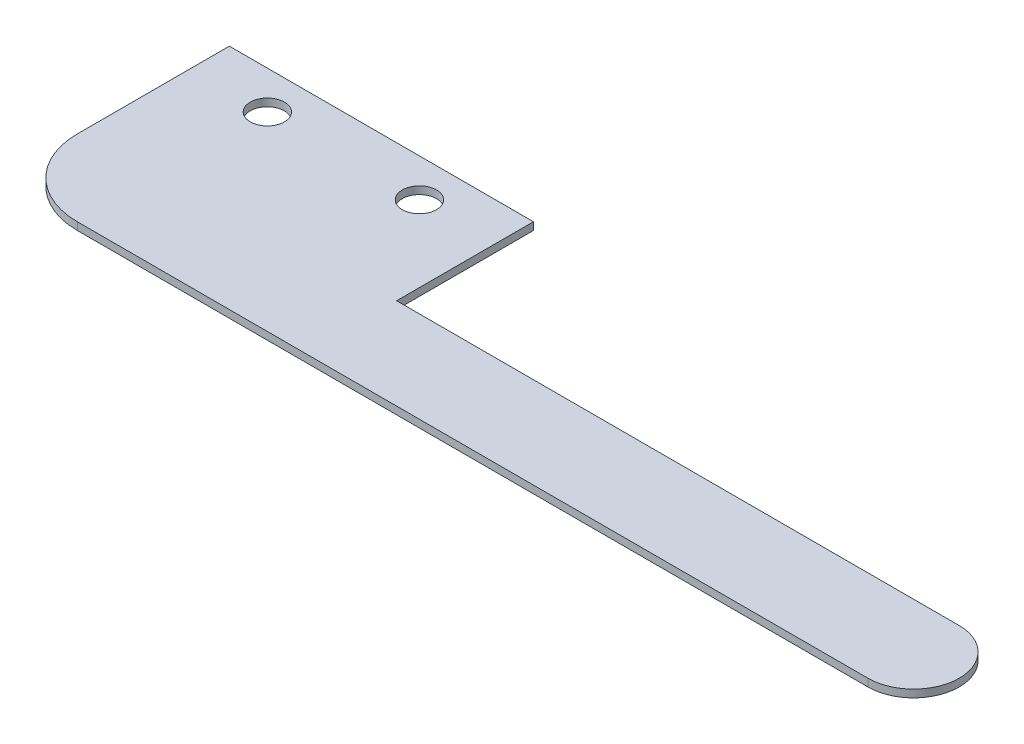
ISO-10303-21;
HEADER;
FILE_DESCRIPTION(('STEP AP214'),'2;1');
FILE_NAME('part.step','',(''),(''),'','','');
FILE_SCHEMA(('AUTOMOTIVE_DESIGN { 1 0 10303 214 1 1 1 1 }'));
ENDSEC;
DATA;
#1=APPLICATION_CONTEXT('core data for automotive mechanical design processes');
#2=APPLICATION_PROTOCOL_DEFINITION('international standard','automotive_design',2000,#1);
#3=PRODUCT_CONTEXT('',#1,'mechanical');
#4=PRODUCT('Part','Part','',(#3));
#5=PRODUCT_RELATED_PRODUCT_CATEGORY('part','',(#4));
#6=PRODUCT_DEFINITION_FORMATION('','',#4);
#7=PRODUCT_DEFINITION_CONTEXT('part definition',#1,'design');
#8=PRODUCT_DEFINITION('design','',#6,#7);
#9=PRODUCT_DEFINITION_SHAPE('','',#8);
#10=(LENGTH_UNIT() NAMED_UNIT(*) SI_UNIT(.MILLI.,.METRE.));
#11=(NAMED_UNIT(*) PLANE_ANGLE_UNIT() SI_UNIT($,.RADIAN.));
#12=(NAMED_UNIT(*) SI_UNIT($,.STERADIAN.) SOLID_ANGLE_UNIT());
#13=UNCERTAINTY_MEASURE_WITH_UNIT(LENGTH_MEASURE(1.E-05),#10,'distance_accuracy_value','');
#14=(GEOMETRIC_REPRESENTATION_CONTEXT(3) GLOBAL_UNCERTAINTY_ASSIGNED_CONTEXT((#13)) GLOBAL_UNIT_ASSIGNED_CONTEXT((#10,
#11,#12)) REPRESENTATION_CONTEXT('',''));
#15=CARTESIAN_POINT('',(0.,0.,0.));
#16=DIRECTION('',(0.,0.,1.));
#17=DIRECTION('',(1.,0.,0.));
#18=AXIS2_PLACEMENT_3D('',#15,#16,#17);
#19=CARTESIAN_POINT('',(10.,1.,-10.));
#20=DIRECTION('',(0.,-1.,0.));
#21=DIRECTION('',(0.,0.,-1.));
#22=AXIS2_PLACEMENT_3D('',#19,#20,#21);
#23=PLANE('',#22);
#24=CARTESIAN_POINT('',(10.,1.,-25.));
#25=DIRECTION('',(0.,1.,0.));
#26=DIRECTION('',(0.,0.,1.));
#27=AXIS2_PLACEMENT_3D('',#24,#25,#26);
#28=CIRCLE('',#27,2.25);
#29=CARTESIAN_POINT('',(10.,1.,-22.75));
#30=VERTEX_POINT('',#29);
#31=EDGE_CURVE('E126',#30,#30,#28,.T.);
#32=ORIENTED_EDGE('',*,*,#31,.F.);
#33=EDGE_LOOP('',(#32));
#34=FACE_BOUND('',#33,.T.);
#35=DIRECTION('',(0.,0.,-1.));
#36=VECTOR('',#35,1.);
#37=CARTESIAN_POINT('',(40.,1.,-12.));
#38=LINE('',#37,#36);
#39=CARTESIAN_POINT('',(40.,1.,-12.));
#40=VERTEX_POINT('',#39);
#41=CARTESIAN_POINT('',(40.,1.,-30.));
#42=VERTEX_POINT('',#41);
#43=EDGE_CURVE('E135',#40,#42,#38,.T.);
#44=ORIENTED_EDGE('',*,*,#43,.T.);
#45=DIRECTION('',(-1.,0.,0.));
#46=VECTOR('',#45,1.);
#47=CARTESIAN_POINT('',(0.,1.,-30.));
#48=LINE('',#47,#46);
#49=CARTESIAN_POINT('',(0.,1.,-30.));
#50=VERTEX_POINT('',#49);
#51=EDGE_CURVE('E88',#42,#50,#48,.T.);
#52=ORIENTED_EDGE('',*,*,#51,.T.);
#53=DIRECTION('',(0.,0.,1.));
#54=VECTOR('',#53,1.);
#55=CARTESIAN_POINT('',(0.,1.,-10.0000000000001));
#56=LINE('',#55,#54);
#57=CARTESIAN_POINT('',(0.,1.,-10.0000000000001));
#58=VERTEX_POINT('',#57);
#59=EDGE_CURVE('E147',#50,#58,#56,.T.);
#60=ORIENTED_EDGE('',*,*,#59,.T.);
#61=CARTESIAN_POINT('',(10.,1.,-10.));
#62=DIRECTION('',(0.,1.,0.));
#63=DIRECTION('',(0.,0.,-1.));
#64=AXIS2_PLACEMENT_3D('',#61,#62,#63);
#65=CIRCLE('',#64,10.);
#66=CARTESIAN_POINT('',(10.0000000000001,1.,0.));
#67=VERTEX_POINT('',#66);
#68=EDGE_CURVE('E104',#58,#67,#65,.T.);
#69=ORIENTED_EDGE('',*,*,#68,.T.);
#70=DIRECTION('',(1.,0.,0.));
#71=VECTOR('',#70,1.);
#72=CARTESIAN_POINT('',(10.0000000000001,1.,0.));
#73=LINE('',#72,#71);
#74=CARTESIAN_POINT('',(114.,1.,0.));
#75=VERTEX_POINT('',#74);
#76=EDGE_CURVE('E98',#67,#75,#73,.T.);
#77=ORIENTED_EDGE('',*,*,#76,.T.);
#78=CARTESIAN_POINT('',(114.,1.,-6.));
#79=DIRECTION('',(0.,1.,0.));
#80=DIRECTION('',(0.,0.,1.));
#81=AXIS2_PLACEMENT_3D('',#78,#79,#80);
#82=CIRCLE('',#81,6.);
#83=CARTESIAN_POINT('',(114.,1.,-12.));
#84=VERTEX_POINT('',#83);
#85=EDGE_CURVE('E102',#75,#84,#82,.T.);
#86=ORIENTED_EDGE('',*,*,#85,.T.);
#87=DIRECTION('',(-1.,0.,0.));
#88=VECTOR('',#87,1.);
#89=CARTESIAN_POINT('',(40.,1.,-12.));
#90=LINE('',#89,#88);
#91=EDGE_CURVE('E48',#84,#40,#90,.T.);
#92=ORIENTED_EDGE('',*,*,#91,.T.);
#93=EDGE_LOOP('',(#44,#52,#60,#69,#77,#86,#92));
#94=FACE_BOUND('',#93,.T.);
#95=CARTESIAN_POINT('',(30.,1.,-25.));
#96=DIRECTION('',(0.,1.,0.));
#97=DIRECTION('',(0.,0.,1.));
#98=AXIS2_PLACEMENT_3D('',#95,#96,#97);
#99=CIRCLE('',#98,2.25);
#100=CARTESIAN_POINT('',(30.,1.,-22.75));
#101=VERTEX_POINT('',#100);
#102=EDGE_CURVE('E162',#101,#101,#99,.T.);
#103=ORIENTED_EDGE('',*,*,#102,.F.);
#104=EDGE_LOOP('',(#103));
#105=FACE_BOUND('',#104,.T.);
#106=ADVANCED_FACE('F31',(#34,#94,#105),#23,.F.);
#107=CARTESIAN_POINT('',(10.,0.,-10.));
#108=DIRECTION('',(0.,-1.,0.));
#109=DIRECTION('',(0.,0.,-1.));
#110=AXIS2_PLACEMENT_3D('',#107,#108,#109);
#111=PLANE('',#110);
#112=CARTESIAN_POINT('',(10.,0.,-25.));
#113=DIRECTION('',(0.,1.,0.));
#114=DIRECTION('',(0.,0.,1.));
#115=AXIS2_PLACEMENT_3D('',#112,#113,#114);
#116=CIRCLE('',#115,2.25);
#117=CARTESIAN_POINT('',(10.,0.,-22.75));
#118=VERTEX_POINT('',#117);
#119=EDGE_CURVE('E159',#118,#118,#116,.T.);
#120=ORIENTED_EDGE('',*,*,#119,.T.);
#121=EDGE_LOOP('',(#120));
#122=FACE_BOUND('',#121,.T.);
#123=DIRECTION('',(0.,0.,-1.));
#124=VECTOR('',#123,1.);
#125=CARTESIAN_POINT('',(40.,0.,-12.));
#126=LINE('',#125,#124);
#127=CARTESIAN_POINT('',(40.,0.,-12.));
#128=VERTEX_POINT('',#127);
#129=CARTESIAN_POINT('',(40.,0.,-30.));
#130=VERTEX_POINT('',#129);
#131=EDGE_CURVE('E122',#128,#130,#126,.T.);
#132=ORIENTED_EDGE('',*,*,#131,.F.);
#133=DIRECTION('',(-1.,0.,0.));
#134=VECTOR('',#133,1.);
#135=CARTESIAN_POINT('',(40.,0.,-12.));
#136=LINE('',#135,#134);
#137=CARTESIAN_POINT('',(114.,0.,-12.));
#138=VERTEX_POINT('',#137);
#139=EDGE_CURVE('E80',#138,#128,#136,.T.);
#140=ORIENTED_EDGE('',*,*,#139,.F.);
#141=CARTESIAN_POINT('',(114.,0.,-6.));
#142=DIRECTION('',(0.,1.,0.));
#143=DIRECTION('',(0.,0.,1.));
#144=AXIS2_PLACEMENT_3D('',#141,#142,#143);
#145=CIRCLE('',#144,6.);
#146=CARTESIAN_POINT('',(114.,0.,0.));
#147=VERTEX_POINT('',#146);
#148=EDGE_CURVE('E74',#147,#138,#145,.T.);
#149=ORIENTED_EDGE('',*,*,#148,.F.);
#150=DIRECTION('',(1.,0.,0.));
#151=VECTOR('',#150,1.);
#152=CARTESIAN_POINT('',(10.0000000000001,0.,0.));
#153=LINE('',#152,#151);
#154=CARTESIAN_POINT('',(10.0000000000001,0.,0.));
#155=VERTEX_POINT('',#154);
#156=EDGE_CURVE('E112',#155,#147,#153,.T.);
#157=ORIENTED_EDGE('',*,*,#156,.F.);
#158=CARTESIAN_POINT('',(10.,0.,-10.));
#159=DIRECTION('',(0.,1.,0.));
#160=DIRECTION('',(0.,0.,-1.));
#161=AXIS2_PLACEMENT_3D('',#158,#159,#160);
#162=CIRCLE('',#161,10.);
#163=CARTESIAN_POINT('',(0.,0.,-10.0000000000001));
#164=VERTEX_POINT('',#163);
#165=EDGE_CURVE('E130',#164,#155,#162,.T.);
#166=ORIENTED_EDGE('',*,*,#165,.F.);
#167=DIRECTION('',(0.,0.,1.));
#168=VECTOR('',#167,1.);
#169=CARTESIAN_POINT('',(0.,0.,-10.0000000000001));
#170=LINE('',#169,#168);
#171=CARTESIAN_POINT('',(0.,0.,-30.));
#172=VERTEX_POINT('',#171);
#173=EDGE_CURVE('E128',#172,#164,#170,.T.);
#174=ORIENTED_EDGE('',*,*,#173,.F.);
#175=DIRECTION('',(-1.,0.,0.));
#176=VECTOR('',#175,1.);
#177=CARTESIAN_POINT('',(0.,0.,-30.));
#178=LINE('',#177,#176);
#179=EDGE_CURVE('E125',#130,#172,#178,.T.);
#180=ORIENTED_EDGE('',*,*,#179,.F.);
#181=EDGE_LOOP('',(#132,#140,#149,#157,#166,#174,#180));
#182=FACE_BOUND('',#181,.T.);
#183=CARTESIAN_POINT('',(30.,0.,-25.));
#184=DIRECTION('',(0.,1.,0.));
#185=DIRECTION('',(0.,0.,1.));
#186=AXIS2_PLACEMENT_3D('',#183,#184,#185);
#187=CIRCLE('',#186,2.25);
#188=CARTESIAN_POINT('',(30.,0.,-22.75));
#189=VERTEX_POINT('',#188);
#190=EDGE_CURVE('E165',#189,#189,#187,.T.);
#191=ORIENTED_EDGE('',*,*,#190,.T.);
#192=EDGE_LOOP('',(#191));
#193=FACE_BOUND('',#192,.T.);
#194=ADVANCED_FACE('F151',(#122,#182,#193),#111,.T.);
#195=CARTESIAN_POINT('',(40.,1.,-12.));
#196=DIRECTION('',(-1.,0.,0.));
#197=DIRECTION('',(0.,0.,1.));
#198=AXIS2_PLACEMENT_3D('',#195,#196,#197);
#199=PLANE('',#198);
#200=ORIENTED_EDGE('',*,*,#131,.T.);
#201=DIRECTION('',(0.,-1.,0.));
#202=VECTOR('',#201,1.);
#203=CARTESIAN_POINT('',(40.,1.,-30.));
#204=LINE('',#203,#202);
#205=EDGE_CURVE('E11',#42,#130,#204,.T.);
#206=ORIENTED_EDGE('',*,*,#205,.F.);
#207=ORIENTED_EDGE('',*,*,#43,.F.);
#208=DIRECTION('',(0.,-1.,0.));
#209=VECTOR('',#208,1.);
#210=CARTESIAN_POINT('',(40.,1.,-12.));
#211=LINE('',#210,#209);
#212=EDGE_CURVE('E118',#40,#128,#211,.T.);
#213=ORIENTED_EDGE('',*,*,#212,.T.);
#214=EDGE_LOOP('',(#200,#206,#207,#213));
#215=FACE_BOUND('',#214,.T.);
#216=ADVANCED_FACE('F33',(#215),#199,.F.);
#217=CARTESIAN_POINT('',(0.,1.,-30.));
#218=DIRECTION('',(0.,0.,1.));
#219=DIRECTION('',(1.,0.,0.));
#220=AXIS2_PLACEMENT_3D('',#217,#218,#219);
#221=PLANE('',#220);
#222=ORIENTED_EDGE('',*,*,#179,.T.);
#223=DIRECTION('',(0.,-1.,0.));
#224=VECTOR('',#223,1.);
#225=CARTESIAN_POINT('',(0.,1.,-30.));
#226=LINE('',#225,#224);
#227=EDGE_CURVE('E40',#50,#172,#226,.T.);
#228=ORIENTED_EDGE('',*,*,#227,.F.);
#229=ORIENTED_EDGE('',*,*,#51,.F.);
#230=ORIENTED_EDGE('',*,*,#205,.T.);
#231=EDGE_LOOP('',(#222,#228,#229,#230));
#232=FACE_BOUND('',#231,.T.);
#233=ADVANCED_FACE('F196',(#232),#221,.F.);
#234=CARTESIAN_POINT('',(0.,1.,-10.0000000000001));
#235=DIRECTION('',(1.,0.,0.));
#236=DIRECTION('',(0.,0.,-1.));
#237=AXIS2_PLACEMENT_3D('',#234,#235,#236);
#238=PLANE('',#237);
#239=ORIENTED_EDGE('',*,*,#173,.T.);
#240=DIRECTION('',(0.,-1.,0.));
#241=VECTOR('',#240,1.);
#242=CARTESIAN_POINT('',(0.,1.,-10.0000000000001));
#243=LINE('',#242,#241);
#244=EDGE_CURVE('E139',#58,#164,#243,.T.);
#245=ORIENTED_EDGE('',*,*,#244,.F.);
#246=ORIENTED_EDGE('',*,*,#59,.F.);
#247=ORIENTED_EDGE('',*,*,#227,.T.);
#248=EDGE_LOOP('',(#239,#245,#246,#247));
#249=FACE_BOUND('',#248,.T.);
#250=ADVANCED_FACE('F145',(#249),#238,.F.);
#251=CARTESIAN_POINT('',(10.,1.,-10.));
#252=DIRECTION('',(0.,-1.,0.));
#253=DIRECTION('',(0.,0.,-1.));
#254=AXIS2_PLACEMENT_3D('',#251,#252,#253);
#255=CYLINDRICAL_SURFACE('',#254,10.);
#256=ORIENTED_EDGE('',*,*,#165,.T.);
#257=DIRECTION('',(0.,-1.,0.));
#258=VECTOR('',#257,1.);
#259=CARTESIAN_POINT('',(10.0000000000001,1.,0.));
#260=LINE('',#259,#258);
#261=EDGE_CURVE('E113',#67,#155,#260,.T.);
#262=ORIENTED_EDGE('',*,*,#261,.F.);
#263=ORIENTED_EDGE('',*,*,#68,.F.);
#264=ORIENTED_EDGE('',*,*,#244,.T.);
#265=EDGE_LOOP('',(#256,#262,#263,#264));
#266=FACE_BOUND('',#265,.T.);
#267=ADVANCED_FACE('F154',(#266),#255,.T.);
#268=CARTESIAN_POINT('',(10.0000000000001,1.,0.));
#269=DIRECTION('',(0.,0.,-1.));
#270=DIRECTION('',(-1.,0.,0.));
#271=AXIS2_PLACEMENT_3D('',#268,#269,#270);
#272=PLANE('',#271);
#273=ORIENTED_EDGE('',*,*,#156,.T.);
#274=DIRECTION('',(0.,-1.,0.));
#275=VECTOR('',#274,1.);
#276=CARTESIAN_POINT('',(114.,1.,0.));
#277=LINE('',#276,#275);
#278=EDGE_CURVE('E109',#75,#147,#277,.T.);
#279=ORIENTED_EDGE('',*,*,#278,.F.);
#280=ORIENTED_EDGE('',*,*,#76,.F.);
#281=ORIENTED_EDGE('',*,*,#261,.T.);
#282=EDGE_LOOP('',(#273,#279,#280,#281));
#283=FACE_BOUND('',#282,.T.);
#284=ADVANCED_FACE('F110',(#283),#272,.F.);
#285=CARTESIAN_POINT('',(114.,1.,-6.));
#286=DIRECTION('',(0.,-1.,0.));
#287=DIRECTION('',(0.,0.,-1.));
#288=AXIS2_PLACEMENT_3D('',#285,#286,#287);
#289=CYLINDRICAL_SURFACE('',#288,6.);
#290=ORIENTED_EDGE('',*,*,#148,.T.);
#291=DIRECTION('',(0.,-1.,0.));
#292=VECTOR('',#291,1.);
#293=CARTESIAN_POINT('',(114.,1.,-12.));
#294=LINE('',#293,#292);
#295=EDGE_CURVE('E114',#84,#138,#294,.T.);
#296=ORIENTED_EDGE('',*,*,#295,.F.);
#297=ORIENTED_EDGE('',*,*,#85,.F.);
#298=ORIENTED_EDGE('',*,*,#278,.T.);
#299=EDGE_LOOP('',(#290,#296,#297,#298));
#300=FACE_BOUND('',#299,.T.);
#301=ADVANCED_FACE('F116',(#300),#289,.T.);
#302=CARTESIAN_POINT('',(40.,1.,-12.));
#303=DIRECTION('',(0.,0.,1.));
#304=DIRECTION('',(1.,0.,0.));
#305=AXIS2_PLACEMENT_3D('',#302,#303,#304);
#306=PLANE('',#305);
#307=ORIENTED_EDGE('',*,*,#139,.T.);
#308=ORIENTED_EDGE('',*,*,#212,.F.);
#309=ORIENTED_EDGE('',*,*,#91,.F.);
#310=ORIENTED_EDGE('',*,*,#295,.T.);
#311=EDGE_LOOP('',(#307,#308,#309,#310));
#312=FACE_BOUND('',#311,.T.);
#313=ADVANCED_FACE('F186',(#312),#306,.F.);
#314=CARTESIAN_POINT('',(10.,1.,-25.));
#315=DIRECTION('',(0.,-1.,0.));
#316=DIRECTION('',(0.,0.,-1.));
#317=AXIS2_PLACEMENT_3D('',#314,#315,#316);
#318=CYLINDRICAL_SURFACE('',#317,2.25);
#319=ORIENTED_EDGE('',*,*,#31,.T.);
#320=EDGE_LOOP('',(#319));
#321=FACE_BOUND('',#320,.T.);
#322=ORIENTED_EDGE('',*,*,#119,.F.);
#323=EDGE_LOOP('',(#322));
#324=FACE_BOUND('',#323,.T.);
#325=ADVANCED_FACE('F183',(#321,#324),#318,.F.);
#326=CARTESIAN_POINT('',(30.,1.,-25.));
#327=DIRECTION('',(0.,-1.,0.));
#328=DIRECTION('',(0.,0.,-1.));
#329=AXIS2_PLACEMENT_3D('',#326,#327,#328);
#330=CYLINDRICAL_SURFACE('',#329,2.25);
#331=ORIENTED_EDGE('',*,*,#102,.T.);
#332=EDGE_LOOP('',(#331));
#333=FACE_BOUND('',#332,.T.);
#334=ORIENTED_EDGE('',*,*,#190,.F.);
#335=EDGE_LOOP('',(#334));
#336=FACE_BOUND('',#335,.T.);
#337=ADVANCED_FACE('F171',(#333,#336),#330,.F.);
#338=CLOSED_SHELL('',(#106,#194,#216,#233,#250,#267,#284,#301,#313,#325,#337));
#339=MANIFOLD_SOLID_BREP('B2',#338);
#340=ADVANCED_BREP_SHAPE_REPRESENTATION('',(#18,#339),#14);
#341=SHAPE_DEFINITION_REPRESENTATION(#9,#340);
ENDSEC;
END-ISO-10303-21;
